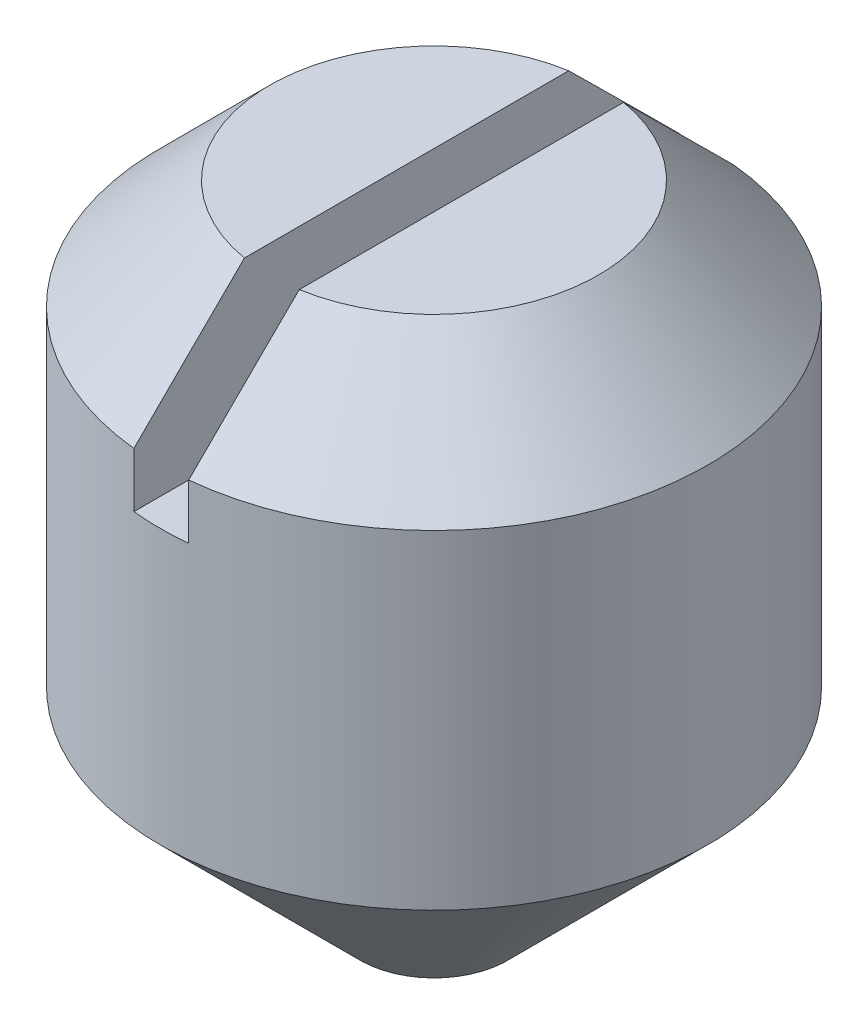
ISO-10303-21;
HEADER;
FILE_DESCRIPTION(('STEP AP214'),'2;1');
FILE_NAME('part.step','',(''),(''),'','','');
FILE_SCHEMA(('AUTOMOTIVE_DESIGN { 1 0 10303 214 1 1 1 1 }'));
ENDSEC;
DATA;
#1=APPLICATION_CONTEXT('core data for automotive mechanical design processes');
#2=APPLICATION_PROTOCOL_DEFINITION('international standard','automotive_design',2000,#1);
#3=PRODUCT_CONTEXT('',#1,'mechanical');
#4=PRODUCT('Part','Part','',(#3));
#5=PRODUCT_RELATED_PRODUCT_CATEGORY('part','',(#4));
#6=PRODUCT_DEFINITION_FORMATION('','',#4);
#7=PRODUCT_DEFINITION_CONTEXT('part definition',#1,'design');
#8=PRODUCT_DEFINITION('design','',#6,#7);
#9=PRODUCT_DEFINITION_SHAPE('','',#8);
#10=(LENGTH_UNIT() NAMED_UNIT(*) SI_UNIT(.MILLI.,.METRE.));
#11=(NAMED_UNIT(*) PLANE_ANGLE_UNIT() SI_UNIT($,.RADIAN.));
#12=(NAMED_UNIT(*) SI_UNIT($,.STERADIAN.) SOLID_ANGLE_UNIT());
#13=UNCERTAINTY_MEASURE_WITH_UNIT(LENGTH_MEASURE(1.E-05),#10,'distance_accuracy_value','');
#14=(GEOMETRIC_REPRESENTATION_CONTEXT(3) GLOBAL_UNCERTAINTY_ASSIGNED_CONTEXT((#13)) GLOBAL_UNIT_ASSIGNED_CONTEXT((#10,
#11,#12)) REPRESENTATION_CONTEXT('',''));
#15=CARTESIAN_POINT('',(0.,0.,0.));
#16=DIRECTION('',(0.,0.,1.));
#17=DIRECTION('',(1.,0.,0.));
#18=AXIS2_PLACEMENT_3D('',#15,#16,#17);
#19=CARTESIAN_POINT('',(0.,4.,0.));
#20=DIRECTION('',(0.,1.,0.));
#21=DIRECTION('',(0.,0.,1.));
#22=AXIS2_PLACEMENT_3D('',#19,#20,#21);
#23=PLANE('',#22);
#24=DIRECTION('',(0.,0.,1.));
#25=VECTOR('',#24,1.);
#26=CARTESIAN_POINT('',(-0.25,4.,-3.1191553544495));
#27=LINE('',#26,#25);
#28=CARTESIAN_POINT('',(-0.25,4.,-1.4790199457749));
#29=VERTEX_POINT('',#28);
#30=CARTESIAN_POINT('',(-0.25,4.,1.4790199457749));
#31=VERTEX_POINT('',#30);
#32=EDGE_CURVE('E89',#29,#31,#27,.T.);
#33=ORIENTED_EDGE('',*,*,#32,.F.);
#34=CARTESIAN_POINT('',(0.,4.,0.));
#35=DIRECTION('',(0.,1.,0.));
#36=DIRECTION('',(0.,0.,1.));
#37=AXIS2_PLACEMENT_3D('',#34,#35,#36);
#38=CIRCLE('',#37,1.5);
#39=EDGE_CURVE('E99',#29,#31,#38,.T.);
#40=ORIENTED_EDGE('',*,*,#39,.T.);
#41=EDGE_LOOP('',(#33,#40));
#42=FACE_BOUND('',#41,.T.);
#43=ADVANCED_FACE('F35',(#42),#23,.T.);
#44=CARTESIAN_POINT('',(0.,4.,0.));
#45=DIRECTION('',(0.,-1.,0.));
#46=DIRECTION('',(0.,0.,-1.));
#47=AXIS2_PLACEMENT_3D('',#44,#45,#46);
#48=CONICAL_SURFACE('',#47,1.5,0.785398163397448);
#49=CARTESIAN_POINT('',(-0.25,-0.0596117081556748,-5.55398796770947));
#50=CARTESIAN_POINT('',(-0.25,0.131834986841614,-5.3623458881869));
#51=CARTESIAN_POINT('',(-0.25,0.32327310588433,-5.17069524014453));
#52=CARTESIAN_POINT('',(-0.25,0.706121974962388,-4.78736493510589));
#53=CARTESIAN_POINT('',(-0.25,0.897532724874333,-4.59568527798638));
#54=CARTESIAN_POINT('',(-0.25,1.28033421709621,-4.21226747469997));
#55=CARTESIAN_POINT('',(-0.25,1.47172495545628,-4.02052932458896));
#56=CARTESIAN_POINT('',(-0.25,1.85444545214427,-3.63699381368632));
#57=CARTESIAN_POINT('',(-0.25,2.0457752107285,-3.44519645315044));
#58=CARTESIAN_POINT('',(-0.25,2.42903971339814,-3.06080387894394));
#59=CARTESIAN_POINT('',(-0.25,2.62097410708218,-2.86820831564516));
#60=CARTESIAN_POINT('',(-0.25,3.00466901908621,-2.48283941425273));
#61=CARTESIAN_POINT('',(-0.25,3.1964295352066,-2.29006607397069));
#62=CARTESIAN_POINT('',(-0.25,3.57960666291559,-1.90420027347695));
#63=CARTESIAN_POINT('',(-0.25,3.77102329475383,-1.71110783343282));
#64=CARTESIAN_POINT('',(-0.25,4.05745949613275,-1.42079340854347));
#65=CARTESIAN_POINT('',(-0.25,4.15282247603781,-1.32391029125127));
#66=CARTESIAN_POINT('',(-0.25,4.34311801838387,-1.12972252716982));
#67=CARTESIAN_POINT('',(-0.25,4.4380505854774,-1.03241788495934));
#68=CARTESIAN_POINT('',(-0.25,4.55828211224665,-0.907952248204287));
#69=CARTESIAN_POINT('',(-0.25,4.58402989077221,-0.881225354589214));
#70=CARTESIAN_POINT('',(-0.25,4.63542503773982,-0.827675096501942));
#71=CARTESIAN_POINT('',(-0.25,4.66107240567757,-0.800851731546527));
#72=CARTESIAN_POINT('',(-0.25,4.73781657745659,-0.720211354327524));
#73=CARTESIAN_POINT('',(-0.25,4.78872525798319,-0.666213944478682));
#74=CARTESIAN_POINT('',(-0.25,4.87288675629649,-0.575289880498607));
#75=CARTESIAN_POINT('',(-0.25,4.90641465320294,-0.538618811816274));
#76=CARTESIAN_POINT('',(-0.25,4.97270277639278,-0.464564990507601));
#77=CARTESIAN_POINT('',(-0.25,5.00546277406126,-0.427182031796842));
#78=CARTESIAN_POINT('',(-0.25,5.06231258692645,-0.359622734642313));
#79=CARTESIAN_POINT('',(-0.25,5.08670297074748,-0.329704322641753));
#80=CARTESIAN_POINT('',(-0.25,5.12193610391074,-0.283771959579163));
#81=CARTESIAN_POINT('',(-0.25,5.13345726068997,-0.26828215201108));
#82=CARTESIAN_POINT('',(-0.25,5.15581806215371,-0.236821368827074));
#83=CARTESIAN_POINT('',(-0.25,5.1666579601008,-0.220850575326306));
#84=CARTESIAN_POINT('',(-0.25,5.18822652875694,-0.186795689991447));
#85=CARTESIAN_POINT('',(-0.25,5.19885957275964,-0.168649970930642));
#86=CARTESIAN_POINT('',(-0.25,5.21808014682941,-0.131282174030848));
#87=CARTESIAN_POINT('',(-0.25,5.2266706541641,-0.11206171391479));
#88=CARTESIAN_POINT('',(-0.25,5.23858184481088,-0.0776230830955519));
#89=CARTESIAN_POINT('',(-0.25,5.24269530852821,-0.0626901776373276));
#90=CARTESIAN_POINT('',(-0.25,5.24834927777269,-0.0323657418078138));
#91=CARTESIAN_POINT('',(-0.25,5.2498983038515,-0.0169759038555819));
#92=CARTESIAN_POINT('',(-0.25,5.25009214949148,0.0138857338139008));
#93=CARTESIAN_POINT('',(-0.25,5.24872517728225,0.029357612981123));
#94=CARTESIAN_POINT('',(-0.25,5.24337818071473,0.0598556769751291));
#95=CARTESIAN_POINT('',(-0.25,5.23939110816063,0.0748805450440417));
#96=CARTESIAN_POINT('',(-0.25,5.22913722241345,0.105295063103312));
#97=CARTESIAN_POINT('',(-0.25,5.22272851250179,0.120634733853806));
#98=CARTESIAN_POINT('',(-0.25,5.20843132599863,0.150620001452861));
#99=CARTESIAN_POINT('',(-0.25,5.20054003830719,0.165264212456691));
#100=CARTESIAN_POINT('',(-0.25,5.18371762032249,0.194094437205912));
#101=CARTESIAN_POINT('',(-0.25,5.17477845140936,0.208275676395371));
#102=CARTESIAN_POINT('',(-0.25,5.15623955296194,0.236175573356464));
#103=CARTESIAN_POINT('',(-0.25,5.1466404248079,0.249894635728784));
#104=CARTESIAN_POINT('',(-0.25,5.1153596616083,0.293034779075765));
#105=CARTESIAN_POINT('',(-0.25,5.09282002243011,0.321828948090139));
#106=CARTESIAN_POINT('',(-0.25,5.04665101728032,0.378535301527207));
#107=CARTESIAN_POINT('',(-0.25,5.02302097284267,0.406446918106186));
#108=CARTESIAN_POINT('',(-0.25,4.9750866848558,0.461762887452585));
#109=CARTESIAN_POINT('',(-0.25,4.95078142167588,0.48916635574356));
#110=CARTESIAN_POINT('',(-0.25,4.90177109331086,0.543614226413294));
#111=CARTESIAN_POINT('',(-0.25,4.87706600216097,0.570658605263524));
#112=CARTESIAN_POINT('',(-0.25,4.80273456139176,0.651241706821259));
#113=CARTESIAN_POINT('',(-0.25,4.75272125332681,0.70442288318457));
#114=CARTESIAN_POINT('',(-0.25,4.65222788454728,0.810234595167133));
#115=CARTESIAN_POINT('',(-0.25,4.60174835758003,0.862865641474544));
#116=CARTESIAN_POINT('',(-0.25,4.45030167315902,1.01987672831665));
#117=CARTESIAN_POINT('',(-0.25,4.34889485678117,1.12383234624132));
#118=CARTESIAN_POINT('',(-0.25,4.14560099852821,1.33127478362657));
#119=CARTESIAN_POINT('',(-0.25,4.04371394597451,1.43476159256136));
#120=CARTESIAN_POINT('',(-0.25,3.83963524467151,1.64152062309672));
#121=CARTESIAN_POINT('',(-0.25,3.73744348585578,1.74479273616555));
#122=CARTESIAN_POINT('',(-0.25,3.53291010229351,1.95118647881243));
#123=CARTESIAN_POINT('',(-0.25,3.43056847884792,2.05430810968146));
#124=CARTESIAN_POINT('',(-0.25,3.12336490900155,2.36357165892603));
#125=CARTESIAN_POINT('',(-0.25,2.91836227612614,2.56957382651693));
#126=CARTESIAN_POINT('',(-0.25,2.50820968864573,2.98138105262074));
#127=CARTESIAN_POINT('',(-0.25,2.3030597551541,3.18718613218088));
#128=CARTESIAN_POINT('',(-0.25,1.91814179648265,3.57314758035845));
#129=CARTESIAN_POINT('',(-0.25,1.73838530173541,3.75331544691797));
#130=CARTESIAN_POINT('',(-0.25,1.37881644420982,4.11360951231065));
#131=CARTESIAN_POINT('',(-0.25,1.1990040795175,4.29373570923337));
#132=CARTESIAN_POINT('',(-0.25,0.839401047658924,4.65389988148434));
#133=CARTESIAN_POINT('',(-0.25,0.65961039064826,4.83393786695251));
#134=CARTESIAN_POINT('',(-0.25,0.30001182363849,5.19398245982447));
#135=CARTESIAN_POINT('',(-0.25,0.120203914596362,5.37398906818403));
#136=CARTESIAN_POINT('',(-0.25,-0.0596117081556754,5.55398796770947));
#137=B_SPLINE_CURVE_WITH_KNOTS('',3,(#49,#50,#51,#52,#53,#54,#55,#56,#57,#58,#59,#60,#61,#62,
#63,#64,#65,#66,#67,#68,#69,#70,#71,#72,#73,#74,#75,#76,#77,#78,#79,#80,#81,#82,#83,#84,#85,#86,
#87,#88,#89,#90,#91,#92,#93,#94,#95,#96,#97,#98,#99,#100,#101,#102,#103,#104,#105,#106,#107,
#108,#109,#110,#111,#112,#113,#114,#115,#116,#117,#118,#119,#120,#121,#122,#123,#124,#125,#126,
#127,#128,#129,#130,#131,#132,#133,#134,#135,#136),.UNSPECIFIED.,.F.,.F.,(4,2,2,2,2,2,2,2,2,2,2,
2,2,2,2,2,2,2,2,2,2,2,2,2,2,2,2,2,2,2,2,2,2,2,2,2,2,2,2,2,2,2,2,4),(0.,0.812654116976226,
1.62531178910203,2.43805121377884,3.25078717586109,4.06649945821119,4.88222191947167,
5.69789465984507,6.10572276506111,6.51354645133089,6.62488113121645,6.73621636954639,
6.9588445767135,7.10790229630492,7.25700384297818,7.37276169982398,7.43066397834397,
7.48854460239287,7.55157276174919,7.61450847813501,7.66080584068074,7.70694906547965,
7.75327923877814,7.79973455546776,7.8494918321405,7.89934442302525,7.94960813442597,
7.99982663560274,8.10946178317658,8.21916609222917,8.32904618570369,8.43893344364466,
8.65793611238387,8.87671323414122,9.31238054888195,9.74805759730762,10.1839178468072,
10.6197743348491,11.4916494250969,12.3634177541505,13.1269331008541,13.8904783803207,
14.6537903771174,15.4170723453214),.UNSPECIFIED.);
#138=CARTESIAN_POINT('',(-0.25,3.,-2.48746859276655));
#139=VERTEX_POINT('',#138);
#140=EDGE_CURVE('E86',#139,#29,#137,.T.);
#141=ORIENTED_EDGE('',*,*,#140,.F.);
#142=CARTESIAN_POINT('',(0.,3.,0.));
#143=DIRECTION('',(0.,1.,0.));
#144=DIRECTION('',(0.,0.,1.));
#145=AXIS2_PLACEMENT_3D('',#142,#143,#144);
#146=CIRCLE('',#145,2.5);
#147=CARTESIAN_POINT('',(-0.25,3.,2.48746859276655));
#148=VERTEX_POINT('',#147);
#149=EDGE_CURVE('E111',#148,#139,#146,.F.);
#150=ORIENTED_EDGE('',*,*,#149,.F.);
#151=EDGE_CURVE('E95',#31,#148,#137,.T.);
#152=ORIENTED_EDGE('',*,*,#151,.F.);
#153=ORIENTED_EDGE('',*,*,#39,.F.);
#154=EDGE_LOOP('',(#141,#150,#152,#153));
#155=FACE_BOUND('',#154,.T.);
#156=ADVANCED_FACE('F102',(#155),#48,.T.);
#157=CARTESIAN_POINT('',(0.,4.,0.));
#158=DIRECTION('',(0.,-1.,0.));
#159=DIRECTION('',(0.,0.,-1.));
#160=AXIS2_PLACEMENT_3D('',#157,#158,#159);
#161=CYLINDRICAL_SURFACE('',#160,2.5);
#162=ORIENTED_EDGE('',*,*,#149,.T.);
#163=DIRECTION('',(0.,-1.,0.));
#164=VECTOR('',#163,1.);
#165=CARTESIAN_POINT('',(-0.25,4.,-2.48746859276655));
#166=LINE('',#165,#164);
#167=CARTESIAN_POINT('',(-0.25,2.5,-2.48746859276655));
#168=VERTEX_POINT('',#167);
#169=EDGE_CURVE('E59',#139,#168,#166,.T.);
#170=ORIENTED_EDGE('',*,*,#169,.T.);
#171=CARTESIAN_POINT('',(0.,2.5,0.));
#172=DIRECTION('',(0.,1.,0.));
#173=DIRECTION('',(0.,0.,1.));
#174=AXIS2_PLACEMENT_3D('',#171,#172,#173);
#175=CIRCLE('',#174,2.5);
#176=CARTESIAN_POINT('',(0.249999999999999,2.5,-2.48746859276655));
#177=VERTEX_POINT('',#176);
#178=EDGE_CURVE('E11',#177,#168,#175,.T.);
#179=ORIENTED_EDGE('',*,*,#178,.F.);
#180=DIRECTION('',(0.,-1.,0.));
#181=VECTOR('',#180,1.);
#182=CARTESIAN_POINT('',(0.25,4.,-2.48746859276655));
#183=LINE('',#182,#181);
#184=CARTESIAN_POINT('',(0.25,3.,-2.48746859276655));
#185=VERTEX_POINT('',#184);
#186=EDGE_CURVE('E162',#177,#185,#183,.F.);
#187=ORIENTED_EDGE('',*,*,#186,.T.);
#188=CARTESIAN_POINT('',(0.25,3.,2.48746859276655));
#189=VERTEX_POINT('',#188);
#190=EDGE_CURVE('E106',#185,#189,#146,.F.);
#191=ORIENTED_EDGE('',*,*,#190,.T.);
#192=DIRECTION('',(0.,-1.,0.));
#193=VECTOR('',#192,1.);
#194=CARTESIAN_POINT('',(0.25,4.,2.48746859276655));
#195=LINE('',#194,#193);
#196=CARTESIAN_POINT('',(0.249999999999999,2.5,2.48746859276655));
#197=VERTEX_POINT('',#196);
#198=EDGE_CURVE('E167',#189,#197,#195,.T.);
#199=ORIENTED_EDGE('',*,*,#198,.T.);
#200=CARTESIAN_POINT('',(-0.25,2.5,2.48746859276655));
#201=VERTEX_POINT('',#200);
#202=EDGE_CURVE('E44',#201,#197,#175,.T.);
#203=ORIENTED_EDGE('',*,*,#202,.F.);
#204=DIRECTION('',(0.,-1.,0.));
#205=VECTOR('',#204,1.);
#206=CARTESIAN_POINT('',(-0.25,4.,2.48746859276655));
#207=LINE('',#206,#205);
#208=EDGE_CURVE('E107',#201,#148,#207,.F.);
#209=ORIENTED_EDGE('',*,*,#208,.T.);
#210=EDGE_LOOP('',(#162,#170,#179,#187,#191,#199,#203,#209));
#211=FACE_BOUND('',#210,.T.);
#212=CARTESIAN_POINT('',(0.,0.,0.));
#213=DIRECTION('',(0.,1.,0.));
#214=DIRECTION('',(-1.,0.,0.));
#215=AXIS2_PLACEMENT_3D('',#212,#213,#214);
#216=CIRCLE('',#215,2.5);
#217=CARTESIAN_POINT('',(-2.5,0.,0.));
#218=VERTEX_POINT('',#217);
#219=EDGE_CURVE('E100',#218,#218,#216,.T.);
#220=ORIENTED_EDGE('',*,*,#219,.T.);
#221=EDGE_LOOP('',(#220));
#222=FACE_BOUND('',#221,.T.);
#223=ADVANCED_FACE('F37',(#211,#222),#161,.T.);
#224=DIRECTION('',(0.,0.,-1.));
#225=VECTOR('',#224,1.);
#226=CARTESIAN_POINT('',(0.25,4.,-3.1191553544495));
#227=LINE('',#226,#225);
#228=CARTESIAN_POINT('',(0.249999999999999,4.,1.4790199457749));
#229=VERTEX_POINT('',#228);
#230=CARTESIAN_POINT('',(0.25,4.,-1.4790199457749));
#231=VERTEX_POINT('',#230);
#232=EDGE_CURVE('E51',#229,#231,#227,.T.);
#233=ORIENTED_EDGE('',*,*,#232,.F.);
#234=EDGE_CURVE('E103',#229,#231,#38,.T.);
#235=ORIENTED_EDGE('',*,*,#234,.T.);
#236=EDGE_LOOP('',(#233,#235));
#237=FACE_BOUND('',#236,.T.);
#238=ADVANCED_FACE('F142',(#237),#23,.T.);
#239=CARTESIAN_POINT('',(0.25,-0.0596117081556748,5.55398796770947));
#240=CARTESIAN_POINT('',(0.25,0.131834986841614,5.3623458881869));
#241=CARTESIAN_POINT('',(0.25,0.32327310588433,5.17069524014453));
#242=CARTESIAN_POINT('',(0.25,0.706121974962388,4.78736493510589));
#243=CARTESIAN_POINT('',(0.25,0.897532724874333,4.59568527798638));
#244=CARTESIAN_POINT('',(0.25,1.28033421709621,4.21226747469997));
#245=CARTESIAN_POINT('',(0.25,1.47172495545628,4.02052932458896));
#246=CARTESIAN_POINT('',(0.25,1.85444545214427,3.63699381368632));
#247=CARTESIAN_POINT('',(0.25,2.0457752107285,3.44519645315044));
#248=CARTESIAN_POINT('',(0.25,2.42903971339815,3.06080387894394));
#249=CARTESIAN_POINT('',(0.25,2.62097410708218,2.86820831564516));
#250=CARTESIAN_POINT('',(0.25,3.00466901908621,2.48283941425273));
#251=CARTESIAN_POINT('',(0.25,3.1964295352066,2.29006607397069));
#252=CARTESIAN_POINT('',(0.25,3.57960666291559,1.90420027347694));
#253=CARTESIAN_POINT('',(0.25,3.77102329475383,1.71110783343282));
#254=CARTESIAN_POINT('',(0.25,4.05745949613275,1.42079340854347));
#255=CARTESIAN_POINT('',(0.25,4.15282247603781,1.32391029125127));
#256=CARTESIAN_POINT('',(0.25,4.34311801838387,1.12972252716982));
#257=CARTESIAN_POINT('',(0.25,4.4380505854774,1.03241788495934));
#258=CARTESIAN_POINT('',(0.25,4.55828211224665,0.907952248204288));
#259=CARTESIAN_POINT('',(0.25,4.58402989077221,0.881225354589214));
#260=CARTESIAN_POINT('',(0.25,4.63542503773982,0.827675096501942));
#261=CARTESIAN_POINT('',(0.25,4.66107240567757,0.800851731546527));
#262=CARTESIAN_POINT('',(0.25,4.73781657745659,0.720211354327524));
#263=CARTESIAN_POINT('',(0.25,4.78872525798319,0.666213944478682));
#264=CARTESIAN_POINT('',(0.25,4.87288675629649,0.575289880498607));
#265=CARTESIAN_POINT('',(0.25,4.90641465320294,0.538618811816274));
#266=CARTESIAN_POINT('',(0.25,4.97270277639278,0.464564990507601));
#267=CARTESIAN_POINT('',(0.25,5.00546277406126,0.427182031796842));
#268=CARTESIAN_POINT('',(0.25,5.06231258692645,0.359622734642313));
#269=CARTESIAN_POINT('',(0.25,5.08670297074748,0.329704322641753));
#270=CARTESIAN_POINT('',(0.25,5.12193610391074,0.283771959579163));
#271=CARTESIAN_POINT('',(0.25,5.13345726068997,0.26828215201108));
#272=CARTESIAN_POINT('',(0.25,5.15581806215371,0.236821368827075));
#273=CARTESIAN_POINT('',(0.25,5.1666579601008,0.220850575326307));
#274=CARTESIAN_POINT('',(0.25,5.18822652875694,0.186795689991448));
#275=CARTESIAN_POINT('',(0.25,5.19885957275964,0.168649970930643));
#276=CARTESIAN_POINT('',(0.25,5.21808014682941,0.13128217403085));
#277=CARTESIAN_POINT('',(0.25,5.2266706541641,0.112061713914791));
#278=CARTESIAN_POINT('',(0.25,5.23858184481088,0.0776230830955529));
#279=CARTESIAN_POINT('',(0.25,5.24269530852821,0.0626901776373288));
#280=CARTESIAN_POINT('',(0.25,5.24834927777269,0.0323657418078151));
#281=CARTESIAN_POINT('',(0.25,5.2498983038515,0.0169759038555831));
#282=CARTESIAN_POINT('',(0.25,5.25009214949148,-0.0138857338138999));
#283=CARTESIAN_POINT('',(0.25,5.24872517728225,-0.0293576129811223));
#284=CARTESIAN_POINT('',(0.25,5.24337818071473,-0.0598556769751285));
#285=CARTESIAN_POINT('',(0.25,5.23939110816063,-0.074880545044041));
#286=CARTESIAN_POINT('',(0.25,5.22913722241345,-0.105295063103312));
#287=CARTESIAN_POINT('',(0.25,5.22272851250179,-0.120634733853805));
#288=CARTESIAN_POINT('',(0.25,5.20843132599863,-0.15062000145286));
#289=CARTESIAN_POINT('',(0.25,5.20054003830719,-0.16526421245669));
#290=CARTESIAN_POINT('',(0.25,5.1837176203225,-0.194094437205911));
#291=CARTESIAN_POINT('',(0.25,5.17477845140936,-0.20827567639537));
#292=CARTESIAN_POINT('',(0.25,5.15623955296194,-0.236175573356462));
#293=CARTESIAN_POINT('',(0.25,5.1466404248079,-0.249894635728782));
#294=CARTESIAN_POINT('',(0.25,5.11535966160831,-0.293034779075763));
#295=CARTESIAN_POINT('',(0.25,5.09282002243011,-0.321828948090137));
#296=CARTESIAN_POINT('',(0.25,5.04665101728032,-0.378535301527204));
#297=CARTESIAN_POINT('',(0.25,5.02302097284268,-0.406446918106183));
#298=CARTESIAN_POINT('',(0.25,4.9750866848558,-0.461762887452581));
#299=CARTESIAN_POINT('',(0.25,4.95078142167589,-0.489166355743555));
#300=CARTESIAN_POINT('',(0.25,4.90177109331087,-0.543614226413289));
#301=CARTESIAN_POINT('',(0.25,4.87706600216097,-0.570658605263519));
#302=CARTESIAN_POINT('',(0.25,4.80273456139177,-0.651241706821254));
#303=CARTESIAN_POINT('',(0.25,4.75272125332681,-0.704422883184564));
#304=CARTESIAN_POINT('',(0.25,4.65222788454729,-0.810234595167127));
#305=CARTESIAN_POINT('',(0.25,4.60174835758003,-0.862865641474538));
#306=CARTESIAN_POINT('',(0.25,4.45030167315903,-1.01987672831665));
#307=CARTESIAN_POINT('',(0.25,4.34889485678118,-1.12383234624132));
#308=CARTESIAN_POINT('',(0.25,4.14560099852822,-1.33127478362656));
#309=CARTESIAN_POINT('',(0.25,4.04371394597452,-1.43476159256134));
#310=CARTESIAN_POINT('',(0.25,3.83963524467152,-1.64152062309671));
#311=CARTESIAN_POINT('',(0.25,3.73744348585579,-1.74479273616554));
#312=CARTESIAN_POINT('',(0.25,3.53291010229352,-1.95118647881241));
#313=CARTESIAN_POINT('',(0.25,3.43056847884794,-2.05430810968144));
#314=CARTESIAN_POINT('',(0.25,3.12336490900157,-2.36357165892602));
#315=CARTESIAN_POINT('',(0.25,2.91836227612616,-2.56957382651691));
#316=CARTESIAN_POINT('',(0.25,2.50820968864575,-2.98138105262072));
#317=CARTESIAN_POINT('',(0.25,2.30305975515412,-3.18718613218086));
#318=CARTESIAN_POINT('',(0.25,1.91814179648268,-3.57314758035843));
#319=CARTESIAN_POINT('',(0.25,1.73838530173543,-3.75331544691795));
#320=CARTESIAN_POINT('',(0.25,1.37881644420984,-4.11360951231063));
#321=CARTESIAN_POINT('',(0.25,1.19900407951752,-4.29373570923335));
#322=CARTESIAN_POINT('',(0.25,0.839401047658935,-4.65389988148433));
#323=CARTESIAN_POINT('',(0.25,0.659610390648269,-4.8339378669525));
#324=CARTESIAN_POINT('',(0.25,0.300011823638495,-5.19398245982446));
#325=CARTESIAN_POINT('',(0.25,0.120203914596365,-5.37398906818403));
#326=CARTESIAN_POINT('',(0.25,-0.0596117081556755,-5.55398796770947));
#327=B_SPLINE_CURVE_WITH_KNOTS('',3,(#239,#240,#241,#242,#243,#244,#245,#246,#247,#248,#249,
#250,#251,#252,#253,#254,#255,#256,#257,#258,#259,#260,#261,#262,#263,#264,#265,#266,#267,#268,
#269,#270,#271,#272,#273,#274,#275,#276,#277,#278,#279,#280,#281,#282,#283,#284,#285,#286,#287,
#288,#289,#290,#291,#292,#293,#294,#295,#296,#297,#298,#299,#300,#301,#302,#303,#304,#305,#306,
#307,#308,#309,#310,#311,#312,#313,#314,#315,#316,#317,#318,#319,#320,#321,#322,#323,#324,#325,
#326),.UNSPECIFIED.,.F.,.F.,(4,2,2,2,2,2,2,2,2,2,2,2,2,2,2,2,2,2,2,2,2,2,2,2,2,2,2,2,2,2,2,2,2,
2,2,2,2,2,2,2,2,2,2,4),(0.,0.812654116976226,1.62531178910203,2.43805121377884,3.25078717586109,
4.06649945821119,4.88222191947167,5.69789465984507,6.10572276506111,6.51354645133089,
6.62488113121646,6.73621636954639,6.9588445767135,7.10790229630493,7.25700384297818,
7.37276169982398,7.43066397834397,7.48854460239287,7.55157276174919,7.61450847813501,
7.66080584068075,7.70694906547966,7.75327923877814,7.79973455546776,7.8494918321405,
7.89934442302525,7.94960813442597,7.99982663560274,8.10946178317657,8.21916609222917,
8.32904618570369,8.43893344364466,8.65793611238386,8.87671323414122,9.31238054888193,
9.7480575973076,10.1839178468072,10.6197743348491,11.4916494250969,12.3634177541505,
13.1269331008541,13.8904783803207,14.6537903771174,15.4170723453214),.UNSPECIFIED.);
#328=EDGE_CURVE('E120',#189,#229,#327,.T.);
#329=ORIENTED_EDGE('',*,*,#328,.F.);
#330=ORIENTED_EDGE('',*,*,#190,.F.);
#331=EDGE_CURVE('E113',#231,#185,#327,.T.);
#332=ORIENTED_EDGE('',*,*,#331,.F.);
#333=ORIENTED_EDGE('',*,*,#234,.F.);
#334=EDGE_LOOP('',(#329,#330,#332,#333));
#335=FACE_BOUND('',#334,.T.);
#336=ADVANCED_FACE('F126',(#335),#48,.T.);
#337=CARTESIAN_POINT('',(-0.25,2.5,3.14127702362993));
#338=DIRECTION('',(0.,1.,0.));
#339=DIRECTION('',(0.,0.,1.));
#340=AXIS2_PLACEMENT_3D('',#337,#338,#339);
#341=PLANE('',#340);
#342=ORIENTED_EDGE('',*,*,#178,.T.);
#343=DIRECTION('',(0.,0.,1.));
#344=VECTOR('',#343,1.);
#345=CARTESIAN_POINT('',(-0.25,2.5,-3.1191553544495));
#346=LINE('',#345,#344);
#347=EDGE_CURVE('E155',#168,#201,#346,.T.);
#348=ORIENTED_EDGE('',*,*,#347,.T.);
#349=ORIENTED_EDGE('',*,*,#202,.T.);
#350=DIRECTION('',(0.,0.,-1.));
#351=VECTOR('',#350,1.);
#352=CARTESIAN_POINT('',(0.25,2.5,-3.1191553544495));
#353=LINE('',#352,#351);
#354=EDGE_CURVE('E168',#197,#177,#353,.T.);
#355=ORIENTED_EDGE('',*,*,#354,.T.);
#356=EDGE_LOOP('',(#342,#348,#349,#355));
#357=FACE_BOUND('',#356,.T.);
#358=ADVANCED_FACE('F133',(#357),#341,.T.);
#359=CARTESIAN_POINT('',(-0.25,2.5,-3.1191553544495));
#360=DIRECTION('',(-1.,0.,0.));
#361=DIRECTION('',(0.,0.,1.));
#362=AXIS2_PLACEMENT_3D('',#359,#360,#361);
#363=PLANE('',#362);
#364=ORIENTED_EDGE('',*,*,#140,.T.);
#365=ORIENTED_EDGE('',*,*,#32,.T.);
#366=ORIENTED_EDGE('',*,*,#151,.T.);
#367=ORIENTED_EDGE('',*,*,#208,.F.);
#368=ORIENTED_EDGE('',*,*,#347,.F.);
#369=ORIENTED_EDGE('',*,*,#169,.F.);
#370=EDGE_LOOP('',(#364,#365,#366,#367,#368,#369));
#371=FACE_BOUND('',#370,.T.);
#372=ADVANCED_FACE('F88',(#371),#363,.F.);
#373=CARTESIAN_POINT('',(0.25,2.5,-3.1191553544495));
#374=DIRECTION('',(1.,0.,0.));
#375=DIRECTION('',(0.,0.,-1.));
#376=AXIS2_PLACEMENT_3D('',#373,#374,#375);
#377=PLANE('',#376);
#378=ORIENTED_EDGE('',*,*,#328,.T.);
#379=ORIENTED_EDGE('',*,*,#232,.T.);
#380=ORIENTED_EDGE('',*,*,#331,.T.);
#381=ORIENTED_EDGE('',*,*,#186,.F.);
#382=ORIENTED_EDGE('',*,*,#354,.F.);
#383=ORIENTED_EDGE('',*,*,#198,.F.);
#384=EDGE_LOOP('',(#378,#379,#380,#381,#382,#383));
#385=FACE_BOUND('',#384,.T.);
#386=ADVANCED_FACE('F128',(#385),#377,.F.);
#387=CARTESIAN_POINT('',(0.,0.,0.));
#388=DIRECTION('',(0.,1.,0.));
#389=DIRECTION('',(-1.,0.,0.));
#390=AXIS2_PLACEMENT_3D('',#387,#388,#389);
#391=CONICAL_SURFACE('',#390,2.5,0.785398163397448);
#392=CARTESIAN_POINT('',(0.,-1.82621082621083,0.));
#393=DIRECTION('',(0.,1.,0.));
#394=DIRECTION('',(0.,0.,1.));
#395=AXIS2_PLACEMENT_3D('',#392,#393,#394);
#396=CIRCLE('',#395,0.673789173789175);
#397=CARTESIAN_POINT('',(-0.673789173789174,-1.82621082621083,0.));
#398=VERTEX_POINT('',#397);
#399=EDGE_CURVE('E39',#398,#398,#396,.F.);
#400=CARTESIAN_POINT('',(-0.673789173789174,-1.82621082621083,0.));
#401=CARTESIAN_POINT('',(-0.69281220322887,-1.80718779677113,0.));
#402=CARTESIAN_POINT('',(-0.711835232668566,-1.78816476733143,0.));
#403=CARTESIAN_POINT('',(-0.749881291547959,-1.75011870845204,0.));
#404=CARTESIAN_POINT('',(-0.768904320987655,-1.73109567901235,0.));
#405=CARTESIAN_POINT('',(-0.806950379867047,-1.69304962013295,0.));
#406=CARTESIAN_POINT('',(-0.825973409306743,-1.67402659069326,0.));
#407=CARTESIAN_POINT('',(-0.864019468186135,-1.63598053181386,0.));
#408=CARTESIAN_POINT('',(-0.883042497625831,-1.61695750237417,0.));
#409=CARTESIAN_POINT('',(-0.921088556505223,-1.57891144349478,0.));
#410=CARTESIAN_POINT('',(-0.94011158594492,-1.55988841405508,0.));
#411=CARTESIAN_POINT('',(-0.978157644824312,-1.52184235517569,0.));
#412=CARTESIAN_POINT('',(-0.997180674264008,-1.50281932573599,0.));
#413=CARTESIAN_POINT('',(-1.0352267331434,-1.4647732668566,0.));
#414=CARTESIAN_POINT('',(-1.0542497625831,-1.4457502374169,0.));
#415=CARTESIAN_POINT('',(-1.09229582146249,-1.40770417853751,0.));
#416=CARTESIAN_POINT('',(-1.11131885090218,-1.38868114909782,0.));
#417=CARTESIAN_POINT('',(-1.14936490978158,-1.35063509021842,0.));
#418=CARTESIAN_POINT('',(-1.16838793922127,-1.33161206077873,0.));
#419=CARTESIAN_POINT('',(-1.20643399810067,-1.29356600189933,0.));
#420=CARTESIAN_POINT('',(-1.22545702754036,-1.27454297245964,0.));
#421=CARTESIAN_POINT('',(-1.26350308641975,-1.23649691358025,0.));
#422=CARTESIAN_POINT('',(-1.28252611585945,-1.21747388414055,0.));
#423=CARTESIAN_POINT('',(-1.32057217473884,-1.17942782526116,0.));
#424=CARTESIAN_POINT('',(-1.33959520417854,-1.16040479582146,0.));
#425=CARTESIAN_POINT('',(-1.37764126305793,-1.12235873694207,0.));
#426=CARTESIAN_POINT('',(-1.39666429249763,-1.10333570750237,0.));
#427=CARTESIAN_POINT('',(-1.43471035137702,-1.06528964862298,0.));
#428=CARTESIAN_POINT('',(-1.45373338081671,-1.04626661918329,0.));
#429=CARTESIAN_POINT('',(-1.49177943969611,-1.00822056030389,0.));
#430=CARTESIAN_POINT('',(-1.5108024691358,-0.989197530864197,0.));
#431=CARTESIAN_POINT('',(-1.54884852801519,-0.951151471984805,0.));
#432=CARTESIAN_POINT('',(-1.56787155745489,-0.932128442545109,0.));
#433=CARTESIAN_POINT('',(-1.60591761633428,-0.894082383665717,0.));
#434=CARTESIAN_POINT('',(-1.62494064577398,-0.875059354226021,0.));
#435=CARTESIAN_POINT('',(-1.66298670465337,-0.837013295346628,0.));
#436=CARTESIAN_POINT('',(-1.68200973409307,-0.817990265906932,0.));
#437=CARTESIAN_POINT('',(-1.72005579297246,-0.77994420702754,0.));
#438=CARTESIAN_POINT('',(-1.73907882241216,-0.760921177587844,0.));
#439=CARTESIAN_POINT('',(-1.77712488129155,-0.722875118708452,0.));
#440=CARTESIAN_POINT('',(-1.79614791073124,-0.703852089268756,0.));
#441=CARTESIAN_POINT('',(-1.83419396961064,-0.665806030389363,0.));
#442=CARTESIAN_POINT('',(-1.85321699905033,-0.646783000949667,0.));
#443=CARTESIAN_POINT('',(-1.89126305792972,-0.608736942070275,0.));
#444=CARTESIAN_POINT('',(-1.91028608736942,-0.589713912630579,0.));
#445=CARTESIAN_POINT('',(-1.94833214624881,-0.551667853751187,0.));
#446=CARTESIAN_POINT('',(-1.96735517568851,-0.532644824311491,0.));
#447=CARTESIAN_POINT('',(-2.0054012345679,-0.494598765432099,0.));
#448=CARTESIAN_POINT('',(-2.0244242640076,-0.475575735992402,0.));
#449=CARTESIAN_POINT('',(-2.06247032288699,-0.43752967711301,0.));
#450=CARTESIAN_POINT('',(-2.08149335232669,-0.418506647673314,0.));
#451=CARTESIAN_POINT('',(-2.11953941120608,-0.380460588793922,0.));
#452=CARTESIAN_POINT('',(-2.13856244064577,-0.361437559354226,0.));
#453=CARTESIAN_POINT('',(-2.17660849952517,-0.323391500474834,0.));
#454=CARTESIAN_POINT('',(-2.19563152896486,-0.304368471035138,0.));
#455=CARTESIAN_POINT('',(-2.23367758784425,-0.266322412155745,0.));
#456=CARTESIAN_POINT('',(-2.25270061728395,-0.247299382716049,0.));
#457=CARTESIAN_POINT('',(-2.29074667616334,-0.209253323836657,0.));
#458=CARTESIAN_POINT('',(-2.30976970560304,-0.190230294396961,0.));
#459=CARTESIAN_POINT('',(-2.34781576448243,-0.152184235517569,0.));
#460=CARTESIAN_POINT('',(-2.36683879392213,-0.133161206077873,0.));
#461=CARTESIAN_POINT('',(-2.40488485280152,-0.0951151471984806,0.));
#462=CARTESIAN_POINT('',(-2.42390788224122,-0.0760921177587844,0.));
#463=CARTESIAN_POINT('',(-2.46195394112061,-0.0380460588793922,0.));
#464=CARTESIAN_POINT('',(-2.4809769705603,-0.0190230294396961,0.));
#465=CARTESIAN_POINT('',(-2.5,0.,0.));
#466=B_SPLINE_CURVE_WITH_KNOTS('',3,(#400,#401,#402,#403,#404,#405,#406,#407,#408,#409,#410,
#411,#412,#413,#414,#415,#416,#417,#418,#419,#420,#421,#422,#423,#424,#425,#426,#427,#428,#429,
#430,#431,#432,#433,#434,#435,#436,#437,#438,#439,#440,#441,#442,#443,#444,#445,#446,#447,#448,
#449,#450,#451,#452,#453,#454,#455,#456,#457,#458,#459,#460,#461,#462,#463,#464,#465),
.UNSPECIFIED.,.F.,.F.,(4,2,2,2,2,2,2,2,2,2,2,2,2,2,2,2,2,2,2,2,2,2,2,2,2,2,2,2,2,2,2,2,4),(0.,
0.0807078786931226,0.161415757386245,0.242123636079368,0.322831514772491,0.403539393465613,
0.484247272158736,0.564955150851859,0.645663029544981,0.726370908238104,0.807078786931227,
0.887786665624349,0.968494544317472,1.04920242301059,1.12991030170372,1.21061818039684,
1.29132605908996,1.37203393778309,1.45274181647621,1.53344969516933,1.61415757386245,
1.69486545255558,1.7755733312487,1.85628120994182,1.93698908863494,2.01769696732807,
2.09840484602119,2.17911272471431,2.25982060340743,2.34052848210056,2.42123636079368,
2.5019442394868,2.58265211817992),.UNSPECIFIED.);
#467=EDGE_CURVE('BSEAM132',#398,#218,#466,.T.);
#468=ORIENTED_EDGE('',*,*,#399,.F.);
#469=ORIENTED_EDGE('',*,*,#219,.F.);
#470=ORIENTED_EDGE('',*,*,#467,.T.);
#471=ORIENTED_EDGE('',*,*,#467,.F.);
#472=EDGE_LOOP('',(#468,#470,#469,#471));
#473=FACE_BOUND('',#472,.T.);
#474=ADVANCED_FACE('F132',(#473),#391,.T.);
#475=CARTESIAN_POINT('',(-3.14312049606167,-1.82621082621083,-2.5));
#476=DIRECTION('',(0.,1.,0.));
#477=DIRECTION('',(0.,0.,1.));
#478=AXIS2_PLACEMENT_3D('',#475,#476,#477);
#479=PLANE('',#478);
#480=ORIENTED_EDGE('',*,*,#399,.T.);
#481=EDGE_LOOP('',(#480));
#482=FACE_BOUND('',#481,.T.);
#483=ADVANCED_FACE('F182',(#482),#479,.F.);
#484=CLOSED_SHELL('',(#43,#156,#223,#238,#336,#358,#372,#386,#474,#483));
#485=MANIFOLD_SOLID_BREP('B2',#484);
#486=ADVANCED_BREP_SHAPE_REPRESENTATION('',(#18,#485),#14);
#487=SHAPE_DEFINITION_REPRESENTATION(#9,#486);
ENDSEC;
END-ISO-10303-21;
